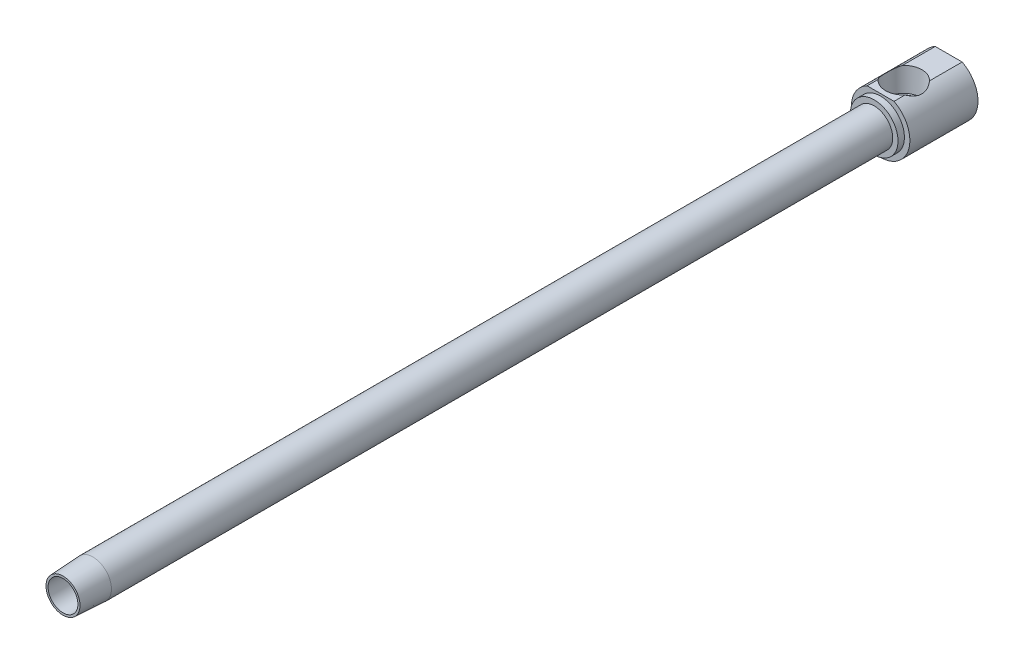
ISO-10303-21;
HEADER;
FILE_DESCRIPTION(('STEP AP214'),'2;1');
FILE_NAME('part.step','',(''),(''),'','','');
FILE_SCHEMA(('AUTOMOTIVE_DESIGN { 1 0 10303 214 1 1 1 1 }'));
ENDSEC;
DATA;
#1=APPLICATION_CONTEXT('core data for automotive mechanical design processes');
#2=APPLICATION_PROTOCOL_DEFINITION('international standard','automotive_design',2000,#1);
#3=PRODUCT_CONTEXT('',#1,'mechanical');
#4=PRODUCT('Part','Part','',(#3));
#5=PRODUCT_RELATED_PRODUCT_CATEGORY('part','',(#4));
#6=PRODUCT_DEFINITION_FORMATION('','',#4);
#7=PRODUCT_DEFINITION_CONTEXT('part definition',#1,'design');
#8=PRODUCT_DEFINITION('design','',#6,#7);
#9=PRODUCT_DEFINITION_SHAPE('','',#8);
#10=(LENGTH_UNIT() NAMED_UNIT(*) SI_UNIT(.MILLI.,.METRE.));
#11=(NAMED_UNIT(*) PLANE_ANGLE_UNIT() SI_UNIT($,.RADIAN.));
#12=(NAMED_UNIT(*) SI_UNIT($,.STERADIAN.) SOLID_ANGLE_UNIT());
#13=UNCERTAINTY_MEASURE_WITH_UNIT(LENGTH_MEASURE(1.E-05),#10,'distance_accuracy_value','');
#14=(GEOMETRIC_REPRESENTATION_CONTEXT(3) GLOBAL_UNCERTAINTY_ASSIGNED_CONTEXT((#13)) GLOBAL_UNIT_ASSIGNED_CONTEXT((#10,
#11,#12)) REPRESENTATION_CONTEXT('',''));
#15=CARTESIAN_POINT('',(0.,0.,0.));
#16=DIRECTION('',(0.,0.,1.));
#17=DIRECTION('',(1.,0.,0.));
#18=AXIS2_PLACEMENT_3D('',#15,#16,#17);
#19=CARTESIAN_POINT('',(0.,0.,-364.122166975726));
#20=DIRECTION('',(0.,0.,-1.));
#21=DIRECTION('',(-1.,0.,0.));
#22=AXIS2_PLACEMENT_3D('',#19,#20,#21);
#23=CYLINDRICAL_SURFACE('',#22,6.9215);
#24=CARTESIAN_POINT('',(0.,0.,-11.147200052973));
#25=DIRECTION('',(0.,0.,-1.));
#26=DIRECTION('',(-1.,0.,0.));
#27=AXIS2_PLACEMENT_3D('',#24,#25,#26);
#28=CIRCLE('',#27,6.9215);
#29=CARTESIAN_POINT('',(-6.9215,0.,-11.147200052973));
#30=VERTEX_POINT('',#29);
#31=EDGE_CURVE('E260',#30,#30,#28,.T.);
#32=ORIENTED_EDGE('',*,*,#31,.T.);
#33=EDGE_LOOP('',(#32));
#34=FACE_BOUND('',#33,.T.);
#35=CARTESIAN_POINT('',(0.,0.,-302.4124));
#36=DIRECTION('',(0.,0.,-1.));
#37=DIRECTION('',(-1.,0.,0.));
#38=AXIS2_PLACEMENT_3D('',#35,#36,#37);
#39=CIRCLE('',#38,6.9215);
#40=CARTESIAN_POINT('',(-6.9215,0.,-302.4124));
#41=VERTEX_POINT('',#40);
#42=EDGE_CURVE('E230',#41,#41,#39,.T.);
#43=ORIENTED_EDGE('',*,*,#42,.F.);
#44=EDGE_LOOP('',(#43));
#45=FACE_BOUND('',#44,.T.);
#46=ADVANCED_FACE('F15',(#34,#45),#23,.T.);
#47=CARTESIAN_POINT('',(-5.0165,9.70179425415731,-288.925));
#48=DIRECTION('',(0.,-1.,0.));
#49=DIRECTION('',(0.,0.,-1.));
#50=AXIS2_PLACEMENT_3D('',#47,#48,#49);
#51=PLANE('',#50);
#52=DIRECTION('',(0.,0.,-1.));
#53=VECTOR('',#52,1.);
#54=CARTESIAN_POINT('',(5.0165,9.70179425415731,-288.925));
#55=LINE('',#54,#53);
#56=CARTESIAN_POINT('',(5.0165,9.70179425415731,-304.8));
#57=VERTEX_POINT('',#56);
#58=CARTESIAN_POINT('',(5.0165,9.70179425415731,-308.88066390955));
#59=VERTEX_POINT('',#58);
#60=EDGE_CURVE('E222',#57,#59,#55,.T.);
#61=ORIENTED_EDGE('',*,*,#60,.T.);
#62=CARTESIAN_POINT('',(0.,9.70179425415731,-313.436));
#63=DIRECTION('',(0.,-1.,0.));
#64=DIRECTION('',(0.,0.,-1.));
#65=AXIS2_PLACEMENT_3D('',#62,#63,#64);
#66=CIRCLE('',#65,6.77616109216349);
#67=CARTESIAN_POINT('',(-5.0165,9.70179425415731,-308.88066390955));
#68=VERTEX_POINT('',#67);
#69=EDGE_CURVE('E10',#59,#68,#66,.T.);
#70=ORIENTED_EDGE('',*,*,#69,.T.);
#71=DIRECTION('',(0.,0.,-1.));
#72=VECTOR('',#71,1.);
#73=CARTESIAN_POINT('',(-5.0165,9.70179425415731,-288.925));
#74=LINE('',#73,#72);
#75=CARTESIAN_POINT('',(-5.0165,9.70179425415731,-304.8));
#76=VERTEX_POINT('',#75);
#77=EDGE_CURVE('E229',#76,#68,#74,.T.);
#78=ORIENTED_EDGE('',*,*,#77,.F.);
#79=DIRECTION('',(1.,0.,0.));
#80=VECTOR('',#79,1.);
#81=CARTESIAN_POINT('',(-8.89,9.70179425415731,-304.8));
#82=LINE('',#81,#80);
#83=EDGE_CURVE('E192',#76,#57,#82,.T.);
#84=ORIENTED_EDGE('',*,*,#83,.T.);
#85=EDGE_LOOP('',(#61,#70,#78,#84));
#86=FACE_BOUND('',#85,.T.);
#87=ADVANCED_FACE('F128',(#86),#51,.F.);
#88=CARTESIAN_POINT('',(-5.55625,0.,-302.387));
#89=DIRECTION('',(0.,0.,1.));
#90=DIRECTION('',(1.,0.,0.));
#91=AXIS2_PLACEMENT_3D('',#88,#89,#90);
#92=PLANE('',#91);
#93=CARTESIAN_POINT('',(0.,0.,-302.387));
#94=DIRECTION('',(0.,0.,-1.));
#95=DIRECTION('',(-1.,0.,0.));
#96=AXIS2_PLACEMENT_3D('',#93,#94,#95);
#97=CIRCLE('',#96,5.55625);
#98=CARTESIAN_POINT('',(-5.55625,0.,-302.387));
#99=VERTEX_POINT('',#98);
#100=EDGE_CURVE('E243',#99,#99,#97,.T.);
#101=ORIENTED_EDGE('',*,*,#100,.F.);
#102=EDGE_LOOP('',(#101));
#103=FACE_BOUND('',#102,.T.);
#104=CARTESIAN_POINT('',(0.,-0.00757924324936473,-302.387));
#105=DIRECTION('',(0.,0.,1.));
#106=DIRECTION('',(0.,1.,0.));
#107=AXIS2_PLACEMENT_3D('',#104,#105,#106);
#108=ELLIPSE('',#107,5.22919092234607,4.47866855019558);
#109=CARTESIAN_POINT('',(0.,5.22161167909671,-302.387));
#110=VERTEX_POINT('',#109);
#111=EDGE_CURVE('E193',#110,#110,#108,.F.);
#112=ORIENTED_EDGE('',*,*,#111,.T.);
#113=EDGE_LOOP('',(#112));
#114=FACE_BOUND('',#113,.T.);
#115=ADVANCED_FACE('F134',(#103,#114),#92,.T.);
#116=CARTESIAN_POINT('',(-5.55625,0.,0.));
#117=DIRECTION('',(0.,0.,1.));
#118=DIRECTION('',(1.,0.,0.));
#119=AXIS2_PLACEMENT_3D('',#116,#117,#118);
#120=PLANE('',#119);
#121=CARTESIAN_POINT('',(0.,0.,0.));
#122=DIRECTION('',(0.,0.,-1.));
#123=DIRECTION('',(-1.,0.,0.));
#124=AXIS2_PLACEMENT_3D('',#121,#122,#123);
#125=CIRCLE('',#124,6.3373);
#126=CARTESIAN_POINT('',(-6.3373,0.,0.));
#127=VERTEX_POINT('',#126);
#128=EDGE_CURVE('E257',#127,#127,#125,.T.);
#129=ORIENTED_EDGE('',*,*,#128,.F.);
#130=EDGE_LOOP('',(#129));
#131=FACE_BOUND('',#130,.T.);
#132=CARTESIAN_POINT('',(0.,0.,0.));
#133=DIRECTION('',(0.,0.,-1.));
#134=DIRECTION('',(-1.,0.,0.));
#135=AXIS2_PLACEMENT_3D('',#132,#133,#134);
#136=CIRCLE('',#135,5.55625);
#137=CARTESIAN_POINT('',(-5.55625,0.,0.));
#138=VERTEX_POINT('',#137);
#139=EDGE_CURVE('E19',#138,#138,#136,.T.);
#140=ORIENTED_EDGE('',*,*,#139,.T.);
#141=EDGE_LOOP('',(#140));
#142=FACE_BOUND('',#141,.T.);
#143=ADVANCED_FACE('F17',(#131,#142),#120,.T.);
#144=CARTESIAN_POINT('',(0.,0.,-364.122166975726));
#145=DIRECTION('',(0.,0.,-1.));
#146=DIRECTION('',(-1.,0.,0.));
#147=AXIS2_PLACEMENT_3D('',#144,#145,#146);
#148=CYLINDRICAL_SURFACE('',#147,5.55625);
#149=ORIENTED_EDGE('',*,*,#100,.T.);
#150=EDGE_LOOP('',(#149));
#151=FACE_BOUND('',#150,.T.);
#152=ORIENTED_EDGE('',*,*,#139,.F.);
#153=EDGE_LOOP('',(#152));
#154=FACE_BOUND('',#153,.T.);
#155=ADVANCED_FACE('F141',(#151,#154),#148,.F.);
#156=CARTESIAN_POINT('',(-10.922,0.,-330.2));
#157=DIRECTION('',(0.,0.,-1.));
#158=DIRECTION('',(-1.,0.,0.));
#159=AXIS2_PLACEMENT_3D('',#156,#157,#158);
#160=PLANE('',#159);
#161=DIRECTION('',(1.,0.,0.));
#162=VECTOR('',#161,1.);
#163=CARTESIAN_POINT('',(-2.7496306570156,4.7625,-330.2));
#164=LINE('',#163,#162);
#165=CARTESIAN_POINT('',(-2.7496306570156,4.7625,-330.2));
#166=VERTEX_POINT('',#165);
#167=CARTESIAN_POINT('',(2.7496306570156,4.7625,-330.2));
#168=VERTEX_POINT('',#167);
#169=EDGE_CURVE('E353',#166,#168,#164,.T.);
#170=ORIENTED_EDGE('',*,*,#169,.F.);
#171=DIRECTION('',(0.5,0.866025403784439,0.));
#172=VECTOR('',#171,1.);
#173=CARTESIAN_POINT('',(-5.49926131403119,0.,-330.2));
#174=LINE('',#173,#172);
#175=CARTESIAN_POINT('',(-5.49926131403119,0.,-330.2));
#176=VERTEX_POINT('',#175);
#177=EDGE_CURVE('E338',#176,#166,#174,.T.);
#178=ORIENTED_EDGE('',*,*,#177,.F.);
#179=DIRECTION('',(-0.5,0.866025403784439,0.));
#180=VECTOR('',#179,1.);
#181=CARTESIAN_POINT('',(-2.7496306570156,-4.7625,-330.2));
#182=LINE('',#181,#180);
#183=CARTESIAN_POINT('',(-2.7496306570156,-4.7625,-330.2));
#184=VERTEX_POINT('',#183);
#185=EDGE_CURVE('E342',#184,#176,#182,.T.);
#186=ORIENTED_EDGE('',*,*,#185,.F.);
#187=DIRECTION('',(-1.,0.,0.));
#188=VECTOR('',#187,1.);
#189=CARTESIAN_POINT('',(2.74963065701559,-4.7625,-330.2));
#190=LINE('',#189,#188);
#191=CARTESIAN_POINT('',(2.74963065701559,-4.7625,-330.2));
#192=VERTEX_POINT('',#191);
#193=EDGE_CURVE('E361',#192,#184,#190,.T.);
#194=ORIENTED_EDGE('',*,*,#193,.F.);
#195=DIRECTION('',(-0.5,-0.866025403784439,0.));
#196=VECTOR('',#195,1.);
#197=CARTESIAN_POINT('',(5.49926131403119,0.,-330.2));
#198=LINE('',#197,#196);
#199=CARTESIAN_POINT('',(5.49926131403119,0.,-330.2));
#200=VERTEX_POINT('',#199);
#201=EDGE_CURVE('E358',#200,#192,#198,.T.);
#202=ORIENTED_EDGE('',*,*,#201,.F.);
#203=DIRECTION('',(0.5,-0.866025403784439,0.));
#204=VECTOR('',#203,1.);
#205=CARTESIAN_POINT('',(2.7496306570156,4.7625,-330.2));
#206=LINE('',#205,#204);
#207=EDGE_CURVE('E355',#168,#200,#206,.T.);
#208=ORIENTED_EDGE('',*,*,#207,.F.);
#209=EDGE_LOOP('',(#170,#178,#186,#194,#202,#208));
#210=FACE_BOUND('',#209,.T.);
#211=DIRECTION('',(-1.,0.,0.));
#212=VECTOR('',#211,1.);
#213=CARTESIAN_POINT('',(-5.0165,9.70179425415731,-330.2));
#214=LINE('',#213,#212);
#215=CARTESIAN_POINT('',(5.0165,9.70179425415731,-330.2));
#216=VERTEX_POINT('',#215);
#217=CARTESIAN_POINT('',(-5.0165,9.70179425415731,-330.2));
#218=VERTEX_POINT('',#217);
#219=EDGE_CURVE('E223',#216,#218,#214,.T.);
#220=ORIENTED_EDGE('',*,*,#219,.F.);
#221=CARTESIAN_POINT('',(0.,0.,-330.2));
#222=DIRECTION('',(0.,0.,-1.));
#223=DIRECTION('',(-1.,0.,0.));
#224=AXIS2_PLACEMENT_3D('',#221,#222,#223);
#225=CIRCLE('',#224,10.922);
#226=EDGE_CURVE('E221',#216,#218,#225,.T.);
#227=ORIENTED_EDGE('',*,*,#226,.T.);
#228=EDGE_LOOP('',(#220,#227));
#229=FACE_BOUND('',#228,.T.);
#230=ADVANCED_FACE('F144',(#210,#229),#160,.T.);
#231=CARTESIAN_POINT('',(0.,0.,-364.122166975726));
#232=DIRECTION('',(0.,0.,-1.));
#233=DIRECTION('',(-1.,0.,0.));
#234=AXIS2_PLACEMENT_3D('',#231,#232,#233);
#235=CYLINDRICAL_SURFACE('',#234,10.922);
#236=CARTESIAN_POINT('',(5.01611318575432,9.70199425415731,-308.880222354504));
#237=CARTESIAN_POINT('',(5.13874600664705,9.63860171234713,-309.020215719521));
#238=CARTESIAN_POINT('',(5.25564164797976,9.57520664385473,-309.165256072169));
#239=CARTESIAN_POINT('',(5.47752086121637,9.45002813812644,-309.464981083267));
#240=CARTESIAN_POINT('',(5.58249714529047,9.38824570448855,-309.619671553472));
#241=CARTESIAN_POINT('',(5.78097274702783,9.26736711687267,-309.939725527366));
#242=CARTESIAN_POINT('',(5.87434183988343,9.20830544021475,-310.10518303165));
#243=CARTESIAN_POINT('',(6.04766375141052,9.09541327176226,-310.444678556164));
#244=CARTESIAN_POINT('',(6.12761848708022,9.04158203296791,-310.618715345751));
#245=CARTESIAN_POINT('',(6.27379640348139,8.94077724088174,-310.975643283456));
#246=CARTESIAN_POINT('',(6.33993919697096,8.89384428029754,-311.158579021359));
#247=CARTESIAN_POINT('',(6.45706504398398,8.80917858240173,-311.531294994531));
#248=CARTESIAN_POINT('',(6.50805163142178,8.7714437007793,-311.721073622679));
#249=CARTESIAN_POINT('',(6.59383346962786,8.70714156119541,-312.105114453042));
#250=CARTESIAN_POINT('',(6.62870831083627,8.68051947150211,-312.299349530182));
#251=CARTESIAN_POINT('',(6.68193856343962,8.63961377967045,-312.691343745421));
#252=CARTESIAN_POINT('',(6.70029794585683,8.6253272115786,-312.889102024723));
#253=CARTESIAN_POINT('',(6.71863048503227,8.61105017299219,-313.25650037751));
#254=CARTESIAN_POINT('',(6.72092722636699,8.6092532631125,-313.425959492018));
#255=CARTESIAN_POINT('',(6.71322085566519,8.61526418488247,-313.764414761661));
#256=CARTESIAN_POINT('',(6.70321892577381,8.6230710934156,-313.933410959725));
#257=CARTESIAN_POINT('',(6.67106070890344,8.64797346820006,-314.269752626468));
#258=CARTESIAN_POINT('',(6.64888985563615,8.66508006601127,-314.437095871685));
#259=CARTESIAN_POINT('',(6.59274566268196,8.70787088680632,-314.768631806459));
#260=CARTESIAN_POINT('',(6.55877214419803,8.73355523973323,-314.932824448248));
#261=CARTESIAN_POINT('',(6.44503992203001,8.81817206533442,-315.397696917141));
#262=CARTESIAN_POINT('',(6.35112179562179,8.88662503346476,-315.693302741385));
#263=CARTESIAN_POINT('',(6.12702756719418,9.04257250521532,-316.264869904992));
#264=CARTESIAN_POINT('',(5.99683851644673,9.13007380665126,-316.540824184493));
#265=CARTESIAN_POINT('',(5.73165005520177,9.2982747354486,-317.018944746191));
#266=CARTESIAN_POINT('',(5.60244827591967,9.37701803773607,-317.225061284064));
#267=CARTESIAN_POINT('',(5.32402625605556,9.53785679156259,-317.620821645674));
#268=CARTESIAN_POINT('',(5.1748707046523,9.61994083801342,-317.810515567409));
#269=CARTESIAN_POINT('',(5.01611318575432,9.70199425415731,-317.991777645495));
#270=B_SPLINE_CURVE_WITH_KNOTS('',3,(#236,#237,#238,#239,#240,#241,#242,#243,#244,#245,#246,
#247,#248,#249,#250,#251,#252,#253,#254,#255,#256,#257,#258,#259,#260,#261,#262,#263,#264,#265,
#266,#267,#268,#269),.UNSPECIFIED.,.F.,.F.,(4,2,2,2,2,2,2,2,2,2,2,2,2,2,2,2,4),(0.,
0.589708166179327,1.17977497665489,1.77595731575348,2.37205438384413,2.97152964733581,
3.57086502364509,4.16720722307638,4.7634059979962,5.2711570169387,5.77885923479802,
6.28717050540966,6.79548947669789,7.74447500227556,8.69379975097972,9.45956340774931,
10.222902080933),.UNSPECIFIED.);
#271=CARTESIAN_POINT('',(5.0165,9.70179425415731,-317.99133609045));
#272=VERTEX_POINT('',#271);
#273=EDGE_CURVE('E31',#59,#272,#270,.T.);
#274=ORIENTED_EDGE('',*,*,#273,.F.);
#275=ORIENTED_EDGE('',*,*,#60,.F.);
#276=CARTESIAN_POINT('',(0.,0.,-304.8));
#277=DIRECTION('',(0.,0.,-1.));
#278=DIRECTION('',(-1.,0.,0.));
#279=AXIS2_PLACEMENT_3D('',#276,#277,#278);
#280=CIRCLE('',#279,10.922);
#281=EDGE_CURVE('E239',#57,#76,#280,.T.);
#282=ORIENTED_EDGE('',*,*,#281,.T.);
#283=ORIENTED_EDGE('',*,*,#77,.T.);
#284=CARTESIAN_POINT('',(-5.01611318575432,9.70199425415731,-317.991777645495));
#285=CARTESIAN_POINT('',(-5.13874600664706,9.63860171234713,-317.851784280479));
#286=CARTESIAN_POINT('',(-5.25564164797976,9.57520664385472,-317.706743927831));
#287=CARTESIAN_POINT('',(-5.47752086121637,9.45002813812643,-317.407018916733));
#288=CARTESIAN_POINT('',(-5.58249714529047,9.38824570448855,-317.252328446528));
#289=CARTESIAN_POINT('',(-5.78097274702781,9.26736711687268,-316.932274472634));
#290=CARTESIAN_POINT('',(-5.8743418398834,9.20830544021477,-316.76681696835));
#291=CARTESIAN_POINT('',(-6.0476637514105,9.09541327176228,-316.427321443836));
#292=CARTESIAN_POINT('',(-6.12761848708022,9.04158203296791,-316.253284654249));
#293=CARTESIAN_POINT('',(-6.27379640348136,8.94077724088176,-315.896356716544));
#294=CARTESIAN_POINT('',(-6.33993919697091,8.89384428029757,-315.713420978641));
#295=CARTESIAN_POINT('',(-6.45706504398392,8.80917858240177,-315.340705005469));
#296=CARTESIAN_POINT('',(-6.50805163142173,8.77144370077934,-315.150926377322));
#297=CARTESIAN_POINT('',(-6.59383346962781,8.70714156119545,-314.766885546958));
#298=CARTESIAN_POINT('',(-6.62870831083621,8.68051947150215,-314.572650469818));
#299=CARTESIAN_POINT('',(-6.68193856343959,8.63961377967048,-314.18065625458));
#300=CARTESIAN_POINT('',(-6.70029794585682,8.62532721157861,-313.982897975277));
#301=CARTESIAN_POINT('',(-6.71863048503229,8.61105017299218,-313.61549962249));
#302=CARTESIAN_POINT('',(-6.720927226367,8.6092532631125,-313.446040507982));
#303=CARTESIAN_POINT('',(-6.7132208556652,8.61526418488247,-313.10758523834));
#304=CARTESIAN_POINT('',(-6.70321892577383,8.62307109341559,-312.938589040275));
#305=CARTESIAN_POINT('',(-6.67106070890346,8.64797346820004,-312.602247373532));
#306=CARTESIAN_POINT('',(-6.64888985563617,8.66508006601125,-312.434904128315));
#307=CARTESIAN_POINT('',(-6.59274566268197,8.70787088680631,-312.103368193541));
#308=CARTESIAN_POINT('',(-6.55877214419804,8.73355523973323,-311.939175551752));
#309=CARTESIAN_POINT('',(-6.44503992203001,8.81817206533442,-311.474303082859));
#310=CARTESIAN_POINT('',(-6.35112179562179,8.88662503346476,-311.178697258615));
#311=CARTESIAN_POINT('',(-6.12702756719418,9.04257250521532,-310.607130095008));
#312=CARTESIAN_POINT('',(-5.99683851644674,9.13007380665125,-310.331175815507));
#313=CARTESIAN_POINT('',(-5.73165005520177,9.2982747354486,-309.853055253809));
#314=CARTESIAN_POINT('',(-5.60244827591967,9.37701803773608,-309.646938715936));
#315=CARTESIAN_POINT('',(-5.32402625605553,9.5378567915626,-309.251178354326));
#316=CARTESIAN_POINT('',(-5.17487070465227,9.61994083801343,-309.061484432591));
#317=CARTESIAN_POINT('',(-5.01611318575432,9.70199425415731,-308.880222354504));
#318=B_SPLINE_CURVE_WITH_KNOTS('',3,(#284,#285,#286,#287,#288,#289,#290,#291,#292,#293,#294,
#295,#296,#297,#298,#299,#300,#301,#302,#303,#304,#305,#306,#307,#308,#309,#310,#311,#312,#313,
#314,#315,#316,#317),.UNSPECIFIED.,.F.,.F.,(4,2,2,2,2,2,2,2,2,2,2,2,2,2,2,2,4),(0.,
0.589708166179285,1.17977497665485,1.77595731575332,2.37205438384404,2.97152964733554,
3.57086502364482,4.16720722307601,4.76340599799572,5.27115701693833,5.77885923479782,
6.28717050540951,6.79548947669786,7.74447500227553,8.69379975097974,9.45956340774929,
10.2229020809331),.UNSPECIFIED.);
#319=CARTESIAN_POINT('',(-5.0165,9.70179425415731,-317.99133609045));
#320=VERTEX_POINT('',#319);
#321=EDGE_CURVE('E161',#320,#68,#318,.T.);
#322=ORIENTED_EDGE('',*,*,#321,.F.);
#323=EDGE_CURVE('E215',#320,#218,#74,.T.);
#324=ORIENTED_EDGE('',*,*,#323,.T.);
#325=ORIENTED_EDGE('',*,*,#226,.F.);
#326=EDGE_CURVE('E213',#272,#216,#55,.T.);
#327=ORIENTED_EDGE('',*,*,#326,.F.);
#328=EDGE_LOOP('',(#274,#275,#282,#283,#322,#324,#325,#327));
#329=FACE_BOUND('',#328,.T.);
#330=ADVANCED_FACE('F151',(#329),#235,.T.);
#331=CARTESIAN_POINT('',(-8.89,0.,-304.8));
#332=DIRECTION('',(0.,0.,1.));
#333=DIRECTION('',(1.,0.,0.));
#334=AXIS2_PLACEMENT_3D('',#331,#332,#333);
#335=PLANE('',#334);
#336=ORIENTED_EDGE('',*,*,#83,.F.);
#337=ORIENTED_EDGE('',*,*,#281,.F.);
#338=EDGE_LOOP('',(#336,#337));
#339=FACE_BOUND('',#338,.T.);
#340=CARTESIAN_POINT('',(0.,0.,-304.8));
#341=DIRECTION('',(0.,0.,-1.));
#342=DIRECTION('',(-1.,0.,0.));
#343=AXIS2_PLACEMENT_3D('',#340,#341,#342);
#344=CIRCLE('',#343,8.89);
#345=CARTESIAN_POINT('',(-8.89,0.,-304.8));
#346=VERTEX_POINT('',#345);
#347=EDGE_CURVE('E236',#346,#346,#344,.T.);
#348=ORIENTED_EDGE('',*,*,#347,.T.);
#349=EDGE_LOOP('',(#348));
#350=FACE_BOUND('',#349,.T.);
#351=ADVANCED_FACE('F156',(#339,#350),#335,.T.);
#352=CARTESIAN_POINT('',(0.,0.,-364.122166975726));
#353=DIRECTION('',(0.,0.,-1.));
#354=DIRECTION('',(-1.,0.,0.));
#355=AXIS2_PLACEMENT_3D('',#352,#353,#354);
#356=CYLINDRICAL_SURFACE('',#355,8.89);
#357=CARTESIAN_POINT('',(0.,0.,-302.4124));
#358=DIRECTION('',(0.,0.,-1.));
#359=DIRECTION('',(-1.,0.,0.));
#360=AXIS2_PLACEMENT_3D('',#357,#358,#359);
#361=CIRCLE('',#360,8.89);
#362=CARTESIAN_POINT('',(-8.89,0.,-302.4124));
#363=VERTEX_POINT('',#362);
#364=EDGE_CURVE('E233',#363,#363,#361,.T.);
#365=ORIENTED_EDGE('',*,*,#364,.T.);
#366=EDGE_LOOP('',(#365));
#367=FACE_BOUND('',#366,.T.);
#368=ORIENTED_EDGE('',*,*,#347,.F.);
#369=EDGE_LOOP('',(#368));
#370=FACE_BOUND('',#369,.T.);
#371=ADVANCED_FACE('F282',(#367,#370),#356,.T.);
#372=CARTESIAN_POINT('',(-6.9215,0.,-302.4124));
#373=DIRECTION('',(0.,0.,1.));
#374=DIRECTION('',(1.,0.,0.));
#375=AXIS2_PLACEMENT_3D('',#372,#373,#374);
#376=PLANE('',#375);
#377=ORIENTED_EDGE('',*,*,#42,.T.);
#378=EDGE_LOOP('',(#377));
#379=FACE_BOUND('',#378,.T.);
#380=ORIENTED_EDGE('',*,*,#364,.F.);
#381=EDGE_LOOP('',(#380));
#382=FACE_BOUND('',#381,.T.);
#383=ADVANCED_FACE('F286',(#379,#382),#376,.T.);
#384=ORIENTED_EDGE('',*,*,#323,.F.);
#385=EDGE_CURVE('E24',#320,#272,#66,.T.);
#386=ORIENTED_EDGE('',*,*,#385,.T.);
#387=ORIENTED_EDGE('',*,*,#326,.T.);
#388=ORIENTED_EDGE('',*,*,#219,.T.);
#389=EDGE_LOOP('',(#384,#386,#387,#388));
#390=FACE_BOUND('',#389,.T.);
#391=ADVANCED_FACE('F137',(#390),#51,.F.);
#392=CARTESIAN_POINT('',(-2.7496306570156,4.7625,-323.85));
#393=DIRECTION('',(0.,1.,0.));
#394=DIRECTION('',(0.,0.,1.));
#395=AXIS2_PLACEMENT_3D('',#392,#393,#394);
#396=PLANE('',#395);
#397=ORIENTED_EDGE('',*,*,#169,.T.);
#398=DIRECTION('',(0.,0.,-1.));
#399=VECTOR('',#398,1.);
#400=CARTESIAN_POINT('',(2.7496306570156,4.7625,-323.85));
#401=LINE('',#400,#399);
#402=CARTESIAN_POINT('',(2.7496306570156,4.7625,-323.85));
#403=VERTEX_POINT('',#402);
#404=EDGE_CURVE('E352',#403,#168,#401,.T.);
#405=ORIENTED_EDGE('',*,*,#404,.F.);
#406=DIRECTION('',(1.,0.,0.));
#407=VECTOR('',#406,1.);
#408=CARTESIAN_POINT('',(-2.7496306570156,4.7625,-323.85));
#409=LINE('',#408,#407);
#410=CARTESIAN_POINT('',(-2.7496306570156,4.7625,-323.85));
#411=VERTEX_POINT('',#410);
#412=EDGE_CURVE('E331',#411,#403,#409,.T.);
#413=ORIENTED_EDGE('',*,*,#412,.F.);
#414=DIRECTION('',(0.,0.,-1.));
#415=VECTOR('',#414,1.);
#416=CARTESIAN_POINT('',(-2.7496306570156,4.7625,-323.85));
#417=LINE('',#416,#415);
#418=EDGE_CURVE('E225',#411,#166,#417,.T.);
#419=ORIENTED_EDGE('',*,*,#418,.T.);
#420=EDGE_LOOP('',(#397,#405,#413,#419));
#421=FACE_BOUND('',#420,.T.);
#422=ADVANCED_FACE('F296',(#421),#396,.F.);
#423=CARTESIAN_POINT('',(-5.49926131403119,0.,-323.85));
#424=DIRECTION('',(-0.866025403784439,0.5,0.));
#425=DIRECTION('',(-0.5,-0.866025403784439,0.));
#426=AXIS2_PLACEMENT_3D('',#423,#424,#425);
#427=PLANE('',#426);
#428=ORIENTED_EDGE('',*,*,#177,.T.);
#429=ORIENTED_EDGE('',*,*,#418,.F.);
#430=DIRECTION('',(0.5,0.866025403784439,0.));
#431=VECTOR('',#430,1.);
#432=CARTESIAN_POINT('',(-5.49926131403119,0.,-323.85));
#433=LINE('',#432,#431);
#434=CARTESIAN_POINT('',(-5.49926131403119,0.,-323.85));
#435=VERTEX_POINT('',#434);
#436=EDGE_CURVE('E337',#435,#411,#433,.T.);
#437=ORIENTED_EDGE('',*,*,#436,.F.);
#438=DIRECTION('',(0.,0.,-1.));
#439=VECTOR('',#438,1.);
#440=CARTESIAN_POINT('',(-5.49926131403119,0.,-323.85));
#441=LINE('',#440,#439);
#442=EDGE_CURVE('E367',#435,#176,#441,.T.);
#443=ORIENTED_EDGE('',*,*,#442,.T.);
#444=EDGE_LOOP('',(#428,#429,#437,#443));
#445=FACE_BOUND('',#444,.T.);
#446=ADVANCED_FACE('F299',(#445),#427,.F.);
#447=CARTESIAN_POINT('',(-2.7496306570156,-4.7625,-323.85));
#448=DIRECTION('',(-0.866025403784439,-0.5,0.));
#449=DIRECTION('',(0.5,-0.866025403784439,0.));
#450=AXIS2_PLACEMENT_3D('',#447,#448,#449);
#451=PLANE('',#450);
#452=ORIENTED_EDGE('',*,*,#185,.T.);
#453=ORIENTED_EDGE('',*,*,#442,.F.);
#454=DIRECTION('',(-0.5,0.866025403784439,0.));
#455=VECTOR('',#454,1.);
#456=CARTESIAN_POINT('',(-2.7496306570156,-4.7625,-323.85));
#457=LINE('',#456,#455);
#458=CARTESIAN_POINT('',(-2.7496306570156,-4.7625,-323.85));
#459=VERTEX_POINT('',#458);
#460=EDGE_CURVE('E349',#459,#435,#457,.T.);
#461=ORIENTED_EDGE('',*,*,#460,.F.);
#462=DIRECTION('',(0.,0.,-1.));
#463=VECTOR('',#462,1.);
#464=CARTESIAN_POINT('',(-2.7496306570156,-4.7625,-323.85));
#465=LINE('',#464,#463);
#466=EDGE_CURVE('E369',#459,#184,#465,.T.);
#467=ORIENTED_EDGE('',*,*,#466,.T.);
#468=EDGE_LOOP('',(#452,#453,#461,#467));
#469=FACE_BOUND('',#468,.T.);
#470=ADVANCED_FACE('F313',(#469),#451,.F.);
#471=CARTESIAN_POINT('',(2.74963065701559,-4.7625,-323.85));
#472=DIRECTION('',(0.,-1.,0.));
#473=DIRECTION('',(1.,0.,0.));
#474=AXIS2_PLACEMENT_3D('',#471,#472,#473);
#475=PLANE('',#474);
#476=ORIENTED_EDGE('',*,*,#193,.T.);
#477=ORIENTED_EDGE('',*,*,#466,.F.);
#478=DIRECTION('',(-1.,0.,0.));
#479=VECTOR('',#478,1.);
#480=CARTESIAN_POINT('',(2.74963065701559,-4.7625,-323.85));
#481=LINE('',#480,#479);
#482=CARTESIAN_POINT('',(2.74963065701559,-4.7625,-323.85));
#483=VERTEX_POINT('',#482);
#484=EDGE_CURVE('E346',#483,#459,#481,.T.);
#485=ORIENTED_EDGE('',*,*,#484,.F.);
#486=DIRECTION('',(0.,0.,-1.));
#487=VECTOR('',#486,1.);
#488=CARTESIAN_POINT('',(2.74963065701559,-4.7625,-323.85));
#489=LINE('',#488,#487);
#490=EDGE_CURVE('E371',#483,#192,#489,.T.);
#491=ORIENTED_EDGE('',*,*,#490,.T.);
#492=EDGE_LOOP('',(#476,#477,#485,#491));
#493=FACE_BOUND('',#492,.T.);
#494=ADVANCED_FACE('F309',(#493),#475,.F.);
#495=CARTESIAN_POINT('',(5.49926131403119,0.,-323.85));
#496=DIRECTION('',(0.866025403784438,-0.5,0.));
#497=DIRECTION('',(0.5,0.866025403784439,0.));
#498=AXIS2_PLACEMENT_3D('',#495,#496,#497);
#499=PLANE('',#498);
#500=ORIENTED_EDGE('',*,*,#201,.T.);
#501=ORIENTED_EDGE('',*,*,#490,.F.);
#502=DIRECTION('',(-0.5,-0.866025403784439,0.));
#503=VECTOR('',#502,1.);
#504=CARTESIAN_POINT('',(5.49926131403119,0.,-323.85));
#505=LINE('',#504,#503);
#506=CARTESIAN_POINT('',(5.49926131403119,0.,-323.85));
#507=VERTEX_POINT('',#506);
#508=EDGE_CURVE('E339',#507,#483,#505,.T.);
#509=ORIENTED_EDGE('',*,*,#508,.F.);
#510=DIRECTION('',(0.,0.,-1.));
#511=VECTOR('',#510,1.);
#512=CARTESIAN_POINT('',(5.49926131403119,0.,-323.85));
#513=LINE('',#512,#511);
#514=EDGE_CURVE('E373',#507,#200,#513,.T.);
#515=ORIENTED_EDGE('',*,*,#514,.T.);
#516=EDGE_LOOP('',(#500,#501,#509,#515));
#517=FACE_BOUND('',#516,.T.);
#518=ADVANCED_FACE('F305',(#517),#499,.F.);
#519=CARTESIAN_POINT('',(2.7496306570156,4.7625,-323.85));
#520=DIRECTION('',(0.866025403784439,0.5,0.));
#521=DIRECTION('',(-0.5,0.866025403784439,0.));
#522=AXIS2_PLACEMENT_3D('',#519,#520,#521);
#523=PLANE('',#522);
#524=ORIENTED_EDGE('',*,*,#207,.T.);
#525=ORIENTED_EDGE('',*,*,#514,.F.);
#526=DIRECTION('',(0.5,-0.866025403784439,0.));
#527=VECTOR('',#526,1.);
#528=CARTESIAN_POINT('',(2.7496306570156,4.7625,-323.85));
#529=LINE('',#528,#527);
#530=EDGE_CURVE('E334',#403,#507,#529,.T.);
#531=ORIENTED_EDGE('',*,*,#530,.F.);
#532=ORIENTED_EDGE('',*,*,#404,.T.);
#533=EDGE_LOOP('',(#524,#525,#531,#532));
#534=FACE_BOUND('',#533,.T.);
#535=ADVANCED_FACE('F301',(#534),#523,.F.);
#536=CARTESIAN_POINT('',(0.,0.,-323.85));
#537=DIRECTION('',(0.,0.,-1.));
#538=DIRECTION('',(-1.,0.,0.));
#539=AXIS2_PLACEMENT_3D('',#536,#537,#538);
#540=PLANE('',#539);
#541=ORIENTED_EDGE('',*,*,#412,.T.);
#542=ORIENTED_EDGE('',*,*,#530,.T.);
#543=ORIENTED_EDGE('',*,*,#508,.T.);
#544=ORIENTED_EDGE('',*,*,#484,.T.);
#545=ORIENTED_EDGE('',*,*,#460,.T.);
#546=ORIENTED_EDGE('',*,*,#436,.T.);
#547=EDGE_LOOP('',(#541,#542,#543,#544,#545,#546));
#548=FACE_BOUND('',#547,.T.);
#549=ADVANCED_FACE('F304',(#548),#540,.T.);
#550=CARTESIAN_POINT('',(0.,-6.20347480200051,-311.770096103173));
#551=DIRECTION('',(0.,0.499512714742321,0.866306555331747));
#552=DIRECTION('',(0.,-0.866306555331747,0.499512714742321));
#553=AXIS2_PLACEMENT_3D('',#550,#551,#552);
#554=CONICAL_SURFACE('',#553,1.6057813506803,1.04663497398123);
#555=CARTESIAN_POINT('',(-1.60598135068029,-4.92366652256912,-312.192483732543));
#556=CARTESIAN_POINT('',(-1.54801586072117,-4.95680342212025,-312.21140561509));
#557=CARTESIAN_POINT('',(-1.4899374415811,-4.9898023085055,-312.230231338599));
#558=CARTESIAN_POINT('',(-1.37340604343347,-5.05537021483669,-312.267594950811));
#559=CARTESIAN_POINT('',(-1.31495289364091,-5.08793901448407,-312.286132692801));
#560=CARTESIAN_POINT('',(-1.19585116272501,-5.15341039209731,-312.323346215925));
#561=CARTESIAN_POINT('',(-1.13518864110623,-5.18629452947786,-312.342009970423));
#562=CARTESIAN_POINT('',(-1.01316854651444,-5.25107049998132,-312.378708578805));
#563=CARTESIAN_POINT('',(-0.951811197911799,-5.28296264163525,-312.396743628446));
#564=CARTESIAN_POINT('',(-0.839118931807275,-5.3396112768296,-312.428707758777));
#565=CARTESIAN_POINT('',(-0.787957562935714,-5.36462261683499,-312.442793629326));
#566=CARTESIAN_POINT('',(-0.684623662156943,-5.41302356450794,-312.469993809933));
#567=CARTESIAN_POINT('',(-0.632451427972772,-5.43641364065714,-312.483108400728));
#568=CARTESIAN_POINT('',(-0.527211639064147,-5.48038053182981,-312.507701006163));
#569=CARTESIAN_POINT('',(-0.474159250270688,-5.50098432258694,-312.519194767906));
#570=CARTESIAN_POINT('',(-0.366152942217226,-5.53798897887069,-312.539788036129));
#571=CARTESIAN_POINT('',(-0.311202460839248,-5.55439703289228,-312.54889163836));
#572=CARTESIAN_POINT('',(-0.224404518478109,-5.57453509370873,-312.560044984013));
#573=CARTESIAN_POINT('',(-0.193292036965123,-5.58064728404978,-312.563425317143));
#574=CARTESIAN_POINT('',(-0.130548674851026,-5.5903048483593,-312.568762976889));
#575=CARTESIAN_POINT('',(-0.0989180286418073,-5.59385135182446,-312.570720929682));
#576=CARTESIAN_POINT('',(-0.0355632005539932,-5.59800285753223,-312.573012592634));
#577=CARTESIAN_POINT('',(-0.00384036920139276,-5.59862312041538,-312.573354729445));
#578=CARTESIAN_POINT('',(0.0594996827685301,-5.59689784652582,-312.572402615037));
#579=CARTESIAN_POINT('',(0.0911168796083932,-5.59455168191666,-312.571108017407));
#580=CARTESIAN_POINT('',(0.198837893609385,-5.58181842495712,-312.564074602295));
#581=CARTESIAN_POINT('',(0.273911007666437,-5.56473069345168,-312.554627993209));
#582=CARTESIAN_POINT('',(0.384150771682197,-5.53190562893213,-312.536402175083));
#583=CARTESIAN_POINT('',(0.420888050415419,-5.5195903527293,-312.529553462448));
#584=CARTESIAN_POINT('',(0.493546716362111,-5.49323102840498,-312.514866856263));
#585=CARTESIAN_POINT('',(0.529468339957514,-5.47918748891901,-312.507029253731));
#586=CARTESIAN_POINT('',(0.61278214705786,-5.44486829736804,-312.487841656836));
#587=CARTESIAN_POINT('',(0.659900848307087,-5.42410253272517,-312.47620641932));
#588=CARTESIAN_POINT('',(0.753260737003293,-5.38113317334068,-312.45207919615));
#589=CARTESIAN_POINT('',(0.799501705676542,-5.35892922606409,-312.439587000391));
#590=CARTESIAN_POINT('',(0.937391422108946,-5.29083562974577,-312.401207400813));
#591=CARTESIAN_POINT('',(1.02808532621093,-5.24351779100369,-312.374446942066));
#592=CARTESIAN_POINT('',(1.20042119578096,-5.15111024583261,-312.32204965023));
#593=CARTESIAN_POINT('',(1.28217710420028,-5.1061732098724,-312.296510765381));
#594=CARTESIAN_POINT('',(1.40412884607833,-5.03811359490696,-312.25776330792));
#595=CARTESIAN_POINT('',(1.44460336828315,-5.01535392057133,-312.244794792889));
#596=CARTESIAN_POINT('',(1.52539869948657,-4.96964276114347,-312.218728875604));
#597=CARTESIAN_POINT('',(1.56571951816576,-4.94669128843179,-312.205631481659));
#598=CARTESIAN_POINT('',(1.60598135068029,-4.92366652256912,-312.192483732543));
#599=B_SPLINE_CURVE_WITH_KNOTS('',3,(#555,#556,#557,#558,#559,#560,#561,#562,#563,#564,#565,
#566,#567,#568,#569,#570,#571,#572,#573,#574,#575,#576,#577,#578,#579,#580,#581,#582,#583,#584,
#585,#586,#587,#588,#589,#590,#591,#592,#593,#594,#595,#596,#597,#598),.UNSPECIFIED.,.F.,.F.,(4,
2,2,2,2,2,2,2,2,2,2,2,2,2,2,2,2,2,2,2,2,4),(0.,0.208197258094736,0.416497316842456,
0.630934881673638,0.84530507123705,1.02127406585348,1.19719199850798,1.37126163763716,
1.54503101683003,1.64057868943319,1.73608427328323,1.83109123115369,1.92611830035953,
2.15701869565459,2.27506343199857,2.39307350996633,2.5513968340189,2.70975911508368,
3.02689190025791,3.31705802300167,3.46169224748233,3.60631720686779),.UNSPECIFIED.);
#600=CARTESIAN_POINT('',(-1.11098322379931,-5.19906341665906,-312.349240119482));
#601=VERTEX_POINT('',#600);
#602=CARTESIAN_POINT('',(1.11098322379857,-5.19906341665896,-312.349240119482));
#603=VERTEX_POINT('',#602);
#604=EDGE_CURVE('E269',#601,#603,#599,.T.);
#605=ORIENTED_EDGE('',*,*,#604,.F.);
#606=CARTESIAN_POINT('',(0.,-6.20347480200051,-311.770096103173));
#607=DIRECTION('',(0.,-0.499512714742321,-0.866306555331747));
#608=DIRECTION('',(0.,0.866306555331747,-0.499512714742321));
#609=AXIS2_PLACEMENT_3D('',#606,#607,#608);
#610=CIRCLE('',#609,1.6057813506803);
#611=EDGE_CURVE('E172',#603,#601,#610,.T.);
#612=ORIENTED_EDGE('',*,*,#611,.F.);
#613=EDGE_LOOP('',(#605,#612));
#614=FACE_BOUND('',#613,.T.);
#615=CARTESIAN_POINT('',(0.,-6.66717404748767,-312.574291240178));
#616=VERTEX_POINT('',#615);
#617=VERTEX_LOOP('',#616);
#618=FACE_BOUND('',#617,.T.);
#619=ADVANCED_FACE('F123',(#614,#618),#554,.F.);
#620=CARTESIAN_POINT('',(0.,0.737834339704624,-299.731760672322));
#621=DIRECTION('',(0.,0.499512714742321,0.866306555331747));
#622=DIRECTION('',(0.,-0.866306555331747,0.499512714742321));
#623=AXIS2_PLACEMENT_3D('',#620,#621,#622);
#624=CONICAL_SURFACE('',#623,5.22642714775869,0.254883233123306);
#625=CARTESIAN_POINT('',(1.01196113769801,-5.32825795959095,-312.572404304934));
#626=CARTESIAN_POINT('',(1.03389680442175,-5.30065791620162,-312.524478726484));
#627=CARTESIAN_POINT('',(1.055404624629,-5.27289731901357,-312.476452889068));
#628=CARTESIAN_POINT('',(1.09769940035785,-5.21711231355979,-312.380240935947));
#629=CARTESIAN_POINT('',(1.11848639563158,-5.18908791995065,-312.332054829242));
#630=CARTESIAN_POINT('',(1.17996400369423,-5.10471123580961,-312.18732712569));
#631=CARTESIAN_POINT('',(1.21977960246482,-5.04804474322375,-312.090597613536));
#632=CARTESIAN_POINT('',(1.2977381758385,-4.93416916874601,-311.896847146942));
#633=CARTESIAN_POINT('',(1.33588180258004,-4.87696030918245,-311.799826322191));
#634=CARTESIAN_POINT('',(1.41092804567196,-4.76213227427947,-311.605540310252));
#635=CARTESIAN_POINT('',(1.44783058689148,-4.70451307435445,-311.508275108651));
#636=CARTESIAN_POINT('',(1.57544445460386,-4.50218372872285,-311.167289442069));
#637=CARTESIAN_POINT('',(1.66369168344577,-4.35670129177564,-310.923107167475));
#638=CARTESIAN_POINT('',(1.83681407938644,-4.06477004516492,-310.434128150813));
#639=CARTESIAN_POINT('',(1.92168912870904,-3.91832120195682,-310.1893313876));
#640=CARTESIAN_POINT('',(2.08932287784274,-3.62468896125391,-309.699100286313));
#641=CARTESIAN_POINT('',(2.17207941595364,-3.4775049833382,-309.453665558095));
#642=CARTESIAN_POINT('',(2.33601111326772,-3.18275206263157,-308.962542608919));
#643=CARTESIAN_POINT('',(2.4171864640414,-3.03518316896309,-308.716854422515));
#644=CARTESIAN_POINT('',(2.4978920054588,-2.88750711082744,-308.471081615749));
#645=B_SPLINE_CURVE_WITH_KNOTS('',3,(#625,#626,#627,#628,#629,#630,#631,#632,#633,#634,#635,
#636,#637,#638,#639,#640,#641,#642,#643,#644),.UNSPECIFIED.,.F.,.F.,(4,2,2,2,2,2,2,2,2,4),(0.,
0.178483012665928,0.356956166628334,0.71383356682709,1.07057050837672,1.427329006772,
2.32014264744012,3.21298744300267,4.10670963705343,5.00032286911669),.UNSPECIFIED.);
#646=CARTESIAN_POINT('',(2.49778278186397,-2.88770711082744,-308.471414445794));
#647=VERTEX_POINT('',#646);
#648=EDGE_CURVE('E205',#603,#647,#645,.T.);
#649=ORIENTED_EDGE('',*,*,#648,.F.);
#650=ORIENTED_EDGE('',*,*,#611,.T.);
#651=CARTESIAN_POINT('',(-2.49789200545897,-2.88750711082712,-308.471081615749));
#652=CARTESIAN_POINT('',(-2.44770652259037,-2.97939053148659,-308.623991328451));
#653=CARTESIAN_POINT('',(-2.39731483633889,-3.07122429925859,-308.77686367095));
#654=CARTESIAN_POINT('',(-2.29600007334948,-3.25476046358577,-309.082515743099));
#655=CARTESIAN_POINT('',(-2.2450769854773,-3.34646285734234,-309.235295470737));
#656=CARTESIAN_POINT('',(-2.14254206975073,-3.52977268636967,-309.540858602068));
#657=CARTESIAN_POINT('',(-2.09092972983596,-3.62137998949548,-309.693641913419));
#658=CARTESIAN_POINT('',(-1.98688424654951,-3.80437404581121,-309.99905856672));
#659=CARTESIAN_POINT('',(-1.93445111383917,-3.89576080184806,-310.15169191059));
#660=CARTESIAN_POINT('',(-1.82863256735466,-4.07804970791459,-310.456449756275));
#661=CARTESIAN_POINT('',(-1.77524935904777,-4.16895247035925,-310.608574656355));
#662=CARTESIAN_POINT('',(-1.66707377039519,-4.35034813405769,-310.912567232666));
#663=CARTESIAN_POINT('',(-1.61228140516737,-4.4408410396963,-311.064434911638));
#664=CARTESIAN_POINT('',(-1.50075171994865,-4.62119778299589,-311.367759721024));
#665=CARTESIAN_POINT('',(-1.44401501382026,-4.71106180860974,-311.519216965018));
#666=CARTESIAN_POINT('',(-1.32768795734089,-4.88985939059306,-311.821580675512));
#667=CARTESIAN_POINT('',(-1.26809785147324,-4.97879302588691,-311.972487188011));
#668=CARTESIAN_POINT('',(-1.19073480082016,-5.08895406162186,-312.160524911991));
#669=CARTESIAN_POINT('',(-1.17511873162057,-5.11093553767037,-312.198101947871));
#670=CARTESIAN_POINT('',(-1.14355086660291,-5.15477909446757,-312.273185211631));
#671=CARTESIAN_POINT('',(-1.12759906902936,-5.1766411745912,-312.310691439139));
#672=CARTESIAN_POINT('',(-1.07914810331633,-5.24202332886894,-312.423097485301));
#673=CARTESIAN_POINT('',(-1.04606024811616,-5.28532942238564,-312.497867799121));
#674=CARTESIAN_POINT('',(-1.01196113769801,-5.32825795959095,-312.572404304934));
#675=B_SPLINE_CURVE_WITH_KNOTS('',3,(#651,#652,#653,#654,#655,#656,#657,#658,#659,#660,#661,
#662,#663,#664,#665,#666,#667,#668,#669,#670,#671,#672,#673,#674),.UNSPECIFIED.,.F.,.F.,(4,2,2,
2,2,2,2,2,2,2,2,4),(0.,0.555952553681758,1.11191677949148,1.66831997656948,2.22471595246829,
2.77995563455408,3.33518936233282,3.89024937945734,4.44526192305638,4.58401142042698,
4.72276164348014,5.00032427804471),.UNSPECIFIED.);
#676=CARTESIAN_POINT('',(-2.49778278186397,-2.88770711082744,-308.471414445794));
#677=VERTEX_POINT('',#676);
#678=EDGE_CURVE('E191',#677,#601,#675,.T.);
#679=ORIENTED_EDGE('',*,*,#678,.F.);
#680=CARTESIAN_POINT('',(2.49782755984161,-2.88790711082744,-308.471436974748));
#681=CARTESIAN_POINT('',(2.48383641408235,-2.82542266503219,-308.46439882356));
#682=CARTESIAN_POINT('',(2.46861957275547,-2.76328396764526,-308.456815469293));
#683=CARTESIAN_POINT('',(2.43577104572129,-2.63978050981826,-308.440663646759));
#684=CARTESIAN_POINT('',(2.41813947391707,-2.57841571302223,-308.43209522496));
#685=CARTESIAN_POINT('',(2.36163791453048,-2.39547590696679,-308.405051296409));
#686=CARTESIAN_POINT('',(2.31918902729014,-2.27517998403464,-308.385251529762));
#687=CARTESIAN_POINT('',(2.22428392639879,-2.03745974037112,-308.342737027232));
#688=CARTESIAN_POINT('',(2.17171615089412,-1.92008566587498,-308.319990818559));
#689=CARTESIAN_POINT('',(2.0567047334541,-1.69074876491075,-308.272681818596));
#690=CARTESIAN_POINT('',(1.99426748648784,-1.57878249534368,-308.248120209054));
#691=CARTESIAN_POINT('',(1.8397697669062,-1.3305945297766,-308.191013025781));
#692=CARTESIAN_POINT('',(1.744331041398,-1.19650697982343,-308.158179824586));
#693=CARTESIAN_POINT('',(1.53495715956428,-0.94379904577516,-308.093538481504));
#694=CARTESIAN_POINT('',(1.42109065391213,-0.82512409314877,-308.061727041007));
#695=CARTESIAN_POINT('',(1.20807079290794,-0.640011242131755,-308.010600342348));
#696=CARTESIAN_POINT('',(1.11379707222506,-0.568272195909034,-307.990288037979));
#697=CARTESIAN_POINT('',(0.914761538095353,-0.439859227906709,-307.953351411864));
#698=CARTESIAN_POINT('',(0.81001440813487,-0.383164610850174,-307.936722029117));
#699=CARTESIAN_POINT('',(0.612541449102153,-0.298431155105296,-307.911625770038));
#700=CARTESIAN_POINT('',(0.521420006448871,-0.266968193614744,-307.902201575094));
#701=CARTESIAN_POINT('',(0.334956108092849,-0.21907718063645,-307.887797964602));
#702=CARTESIAN_POINT('',(0.239617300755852,-0.20263639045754,-307.882814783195));
#703=CARTESIAN_POINT('',(0.0470109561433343,-0.186228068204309,-307.877841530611));
#704=CARTESIAN_POINT('',(-0.0502624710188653,-0.186322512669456,-307.877870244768));
#705=CARTESIAN_POINT('',(-0.243227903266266,-0.203132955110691,-307.882965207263));
#706=CARTESIAN_POINT('',(-0.338919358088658,-0.219854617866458,-307.88803317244));
#707=CARTESIAN_POINT('',(-0.521251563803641,-0.267164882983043,-307.902259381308));
#708=CARTESIAN_POINT('',(-0.608105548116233,-0.297016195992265,-307.91119980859));
#709=CARTESIAN_POINT('',(-0.776430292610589,-0.368311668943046,-307.932329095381));
#710=CARTESIAN_POINT('',(-0.857899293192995,-0.409759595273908,-307.944519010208));
#711=CARTESIAN_POINT('',(-1.05967586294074,-0.528631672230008,-307.979006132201));
#712=CARTESIAN_POINT('',(-1.17553777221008,-0.613071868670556,-308.003095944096));
#713=CARTESIAN_POINT('',(-1.39218142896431,-0.798819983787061,-308.054518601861));
#714=CARTESIAN_POINT('',(-1.49291384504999,-0.900180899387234,-308.081861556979));
#715=CARTESIAN_POINT('',(-1.65718256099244,-1.08871747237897,-308.130795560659));
#716=CARTESIAN_POINT('',(-1.72379796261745,-1.17332105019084,-308.152162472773));
#717=CARTESIAN_POINT('',(-1.84937081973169,-1.34811375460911,-308.194792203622));
#718=CARTESIAN_POINT('',(-1.9083239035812,-1.43830602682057,-308.21605495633));
#719=CARTESIAN_POINT('',(-2.01897203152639,-1.62326479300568,-308.257846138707));
#720=CARTESIAN_POINT('',(-2.07066203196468,-1.7180344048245,-308.278374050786));
#721=CARTESIAN_POINT('',(-2.16700410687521,-1.91129054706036,-308.318106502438));
#722=CARTESIAN_POINT('',(-2.21165858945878,-2.0097757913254,-308.337311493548));
#723=CARTESIAN_POINT('',(-2.30465900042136,-2.23552717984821,-308.378551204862));
#724=CARTESIAN_POINT('',(-2.35102978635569,-2.36371403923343,-308.400054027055));
#725=CARTESIAN_POINT('',(-2.41232360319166,-2.55862165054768,-308.429281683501));
#726=CARTESIAN_POINT('',(-2.43134086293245,-2.6238640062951,-308.438500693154));
#727=CARTESIAN_POINT('',(-2.4666442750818,-2.7552417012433,-308.455831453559));
#728=CARTESIAN_POINT('',(-2.48292991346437,-2.82137720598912,-308.463942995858));
#729=CARTESIAN_POINT('',(-2.49782755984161,-2.88790711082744,-308.471436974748));
#730=B_SPLINE_CURVE_WITH_KNOTS('',3,(#680,#681,#682,#683,#684,#685,#686,#687,#688,#689,#690,
#691,#692,#693,#694,#695,#696,#697,#698,#699,#700,#701,#702,#703,#704,#705,#706,#707,#708,#709,
#710,#711,#712,#713,#714,#715,#716,#717,#718,#719,#720,#721,#722,#723,#724,#725,#726,#727,#728,
#729),.UNSPECIFIED.,.F.,.F.,(4,2,2,2,2,2,2,2,2,2,2,2,2,2,2,2,2,2,2,2,2,2,2,2,4),(0.,
0.193219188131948,0.386429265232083,0.773233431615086,1.16457552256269,1.55566507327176,
2.05774384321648,2.55799349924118,2.91743960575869,3.27638866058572,3.56577369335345,
3.85491310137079,4.14513627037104,4.43545835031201,4.7112243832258,4.98708008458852,
5.42075552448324,5.85581566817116,6.18473767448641,6.51384652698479,6.8431828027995,
7.17240610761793,7.58580190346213,7.79148391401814,7.99720458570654),.UNSPECIFIED.);
#731=EDGE_CURVE('E185',#647,#677,#730,.T.);
#732=ORIENTED_EDGE('',*,*,#731,.F.);
#733=EDGE_LOOP('',(#649,#650,#679,#732));
#734=FACE_BOUND('',#733,.T.);
#735=ORIENTED_EDGE('',*,*,#111,.F.);
#736=EDGE_LOOP('',(#735));
#737=FACE_BOUND('',#736,.T.);
#738=ADVANCED_FACE('F112',(#734,#737),#624,.F.);
#739=CARTESIAN_POINT('',(0.,-6.09634277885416,-313.436));
#740=DIRECTION('',(0.,1.,0.));
#741=DIRECTION('',(0.,0.,1.));
#742=AXIS2_PLACEMENT_3D('',#739,#740,#741);
#743=CONICAL_SURFACE('',#742,0.,1.0471975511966);
#744=ORIENTED_EDGE('',*,*,#648,.T.);
#745=CARTESIAN_POINT('',(0.,-2.88770711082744,-313.436));
#746=DIRECTION('',(0.,-1.,0.));
#747=DIRECTION('',(0.,0.,-1.));
#748=AXIS2_PLACEMENT_3D('',#745,#746,#747);
#749=CIRCLE('',#748,5.55752);
#750=EDGE_CURVE('E38',#677,#647,#749,.T.);
#751=ORIENTED_EDGE('',*,*,#750,.F.);
#752=ORIENTED_EDGE('',*,*,#678,.T.);
#753=ORIENTED_EDGE('',*,*,#604,.T.);
#754=EDGE_LOOP('',(#744,#751,#752,#753));
#755=FACE_BOUND('',#754,.T.);
#756=CARTESIAN_POINT('',(0.,-6.09634277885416,-313.436));
#757=VERTEX_POINT('',#756);
#758=VERTEX_LOOP('',#757);
#759=FACE_BOUND('',#758,.T.);
#760=ADVANCED_FACE('F109',(#755,#759),#743,.F.);
#761=CARTESIAN_POINT('',(0.,9.70179425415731,-313.436));
#762=DIRECTION('',(0.,-1.,0.));
#763=DIRECTION('',(0.,0.,-1.));
#764=AXIS2_PLACEMENT_3D('',#761,#762,#763);
#765=CYLINDRICAL_SURFACE('',#764,5.55752);
#766=ORIENTED_EDGE('',*,*,#731,.T.);
#767=ORIENTED_EDGE('',*,*,#750,.T.);
#768=EDGE_LOOP('',(#766,#767));
#769=FACE_BOUND('',#768,.T.);
#770=CARTESIAN_POINT('',(0.,0.990599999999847,-313.436));
#771=DIRECTION('',(0.,-1.,0.));
#772=DIRECTION('',(0.,0.,-1.));
#773=AXIS2_PLACEMENT_3D('',#770,#771,#772);
#774=CIRCLE('',#773,5.55752);
#775=CARTESIAN_POINT('',(0.,0.990599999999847,-318.99352));
#776=VERTEX_POINT('',#775);
#777=EDGE_CURVE('E263',#776,#776,#774,.T.);
#778=ORIENTED_EDGE('',*,*,#777,.F.);
#779=EDGE_LOOP('',(#778));
#780=FACE_BOUND('',#779,.T.);
#781=ADVANCED_FACE('F111',(#769,#780),#765,.F.);
#782=CARTESIAN_POINT('',(0.,0.990599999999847,-319.754820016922));
#783=DIRECTION('',(0.,-1.,0.));
#784=DIRECTION('',(0.,0.,-1.));
#785=AXIS2_PLACEMENT_3D('',#782,#783,#784);
#786=PLANE('',#785);
#787=CARTESIAN_POINT('',(0.,0.990599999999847,-313.436));
#788=DIRECTION('',(0.,-1.,0.));
#789=DIRECTION('',(0.,0.,-1.));
#790=AXIS2_PLACEMENT_3D('',#787,#788,#789);
#791=CIRCLE('',#790,6.31882001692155);
#792=CARTESIAN_POINT('',(0.,0.990599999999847,-319.754820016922));
#793=VERTEX_POINT('',#792);
#794=EDGE_CURVE('E259',#793,#793,#791,.T.);
#795=ORIENTED_EDGE('',*,*,#794,.F.);
#796=EDGE_LOOP('',(#795));
#797=FACE_BOUND('',#796,.T.);
#798=ORIENTED_EDGE('',*,*,#777,.T.);
#799=EDGE_LOOP('',(#798));
#800=FACE_BOUND('',#799,.T.);
#801=ADVANCED_FACE('F121',(#797,#800),#786,.F.);
#802=CARTESIAN_POINT('',(0.,0.990599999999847,-313.436));
#803=DIRECTION('',(0.,1.,0.));
#804=DIRECTION('',(0.,0.,1.));
#805=AXIS2_PLACEMENT_3D('',#802,#803,#804);
#806=CONICAL_SURFACE('',#805,6.31882001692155,0.0524522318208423);
#807=ORIENTED_EDGE('',*,*,#273,.T.);
#808=ORIENTED_EDGE('',*,*,#385,.F.);
#809=ORIENTED_EDGE('',*,*,#321,.T.);
#810=ORIENTED_EDGE('',*,*,#69,.F.);
#811=EDGE_LOOP('',(#807,#808,#809,#810));
#812=FACE_BOUND('',#811,.T.);
#813=ORIENTED_EDGE('',*,*,#794,.T.);
#814=EDGE_LOOP('',(#813));
#815=FACE_BOUND('',#814,.T.);
#816=ADVANCED_FACE('F174',(#812,#815),#806,.F.);
#817=CARTESIAN_POINT('',(0.,0.,0.));
#818=DIRECTION('',(0.,0.,-1.));
#819=DIRECTION('',(-1.,0.,0.));
#820=AXIS2_PLACEMENT_3D('',#817,#818,#819);
#821=CONICAL_SURFACE('',#820,6.3373,0.0523598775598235);
#822=ORIENTED_EDGE('',*,*,#31,.F.);
#823=EDGE_LOOP('',(#822));
#824=FACE_BOUND('',#823,.T.);
#825=ORIENTED_EDGE('',*,*,#128,.T.);
#826=EDGE_LOOP('',(#825));
#827=FACE_BOUND('',#826,.T.);
#828=ADVANCED_FACE('F179',(#824,#827),#821,.T.);
#829=CLOSED_SHELL('',(#46,#87,#115,#143,#155,#230,#330,#351,#371,#383,#391,#422,#446,#470,#494,
#518,#535,#549,#619,#738,#760,#781,#801,#816,#828));
#830=MANIFOLD_SOLID_BREP('B1',#829);
#831=ADVANCED_BREP_SHAPE_REPRESENTATION('',(#18,#830),#14);
#832=SHAPE_DEFINITION_REPRESENTATION(#9,#831);
ENDSEC;
END-ISO-10303-21;
